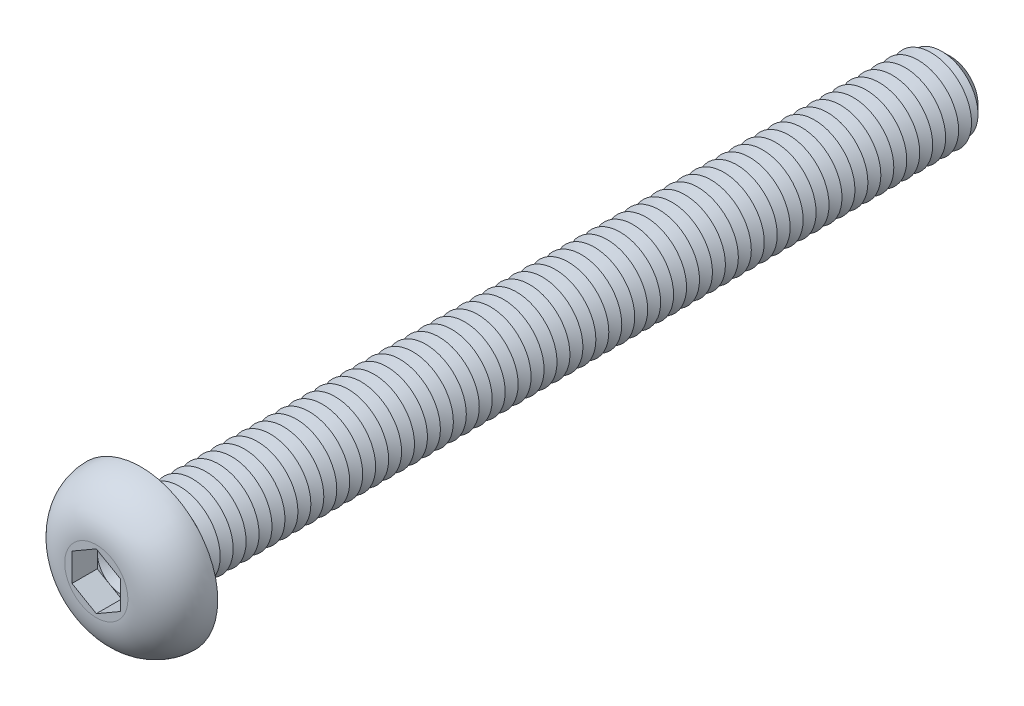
from build123d import *

# Parameters (mm, degrees)
CUT_EXTRUDE1_DEPTH  = 1.56
SKETCH4_R           = 2.5
BOSS_EXTRUDE1_DEPTH = 50
CHAMFER1_SIZE       = 0.8
LPATTERN1_COUNT     = 61
LPATTERN1_PITCH     = 0.8
FILLET2_R           = 0.4


with BuildPart() as part:
    # Sketch2 → Revolve1 (revolve)
    with BuildSketch(Plane(origin=(0, 0, 0), x_dir=(0, 0, -1), z_dir=(1, 0, 0)), mode=Mode.PRIVATE) as revolve1_sk:
        with BuildLine():
            Line((0, 0), (-2.75, 0))
            Line((-2.75, 0), (-2.75, 1.950446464))
            ThreePointArc((-2.75, 1.950446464), (-1.947498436, 3.912588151), (0, 4.75))
            Line((0, 4.75), (0, 0))
        make_face()
    revolve(revolve1_sk.sketch.rotate(Axis((0, 0, 47.934239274), (0, 0, -1)), 90), axis=Axis((0, 0, 47.934239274), (0, 0, -1)))

    # Sketch3 → Cut-Extrude1 (cut)
    with BuildSketch(Plane.XY.offset(2.75)):
        Polygon((0, 1.732050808), (-1.5, 0.866025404), (-1.5, -0.866025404), (0, -1.732050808), (1.5, -0.866025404), (1.5, 0.866025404), align=None)
    extrude(amount=-CUT_EXTRUDE1_DEPTH, mode=Mode.SUBTRACT)

    # Sketch4 → Boss-Extrude1 (add)
    with BuildSketch(Plane(origin=(0, 0, 0), x_dir=(-1, 0, 0), z_dir=(0, 0, -1))):
        with Locations(Location((0, 0, 0), (0, 0, 180))):
            Circle(SKETCH4_R)
    extrude(amount=BOSS_EXTRUDE1_DEPTH)

    # Chamfer1
    chamfer1_edges = [part.edges().sort_by_distance(p)[0] for p in [
        (-2.5, 0, -50),
    ]]
    chamfer(chamfer1_edges, length=CHAMFER1_SIZE)

    # Sketch5 → Cut-Revolve1 (revolve, cut)
    with BuildSketch(Plane(origin=(0, 0, 0), x_dir=(0, 0, -1), z_dir=(1, 0, 0)), mode=Mode.PRIVATE) as cut_revolve1_sk:
        Polygon((0.8, 2.5), (1.6, 2.5), (1.2, 1.807179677), align=None)
    cut_revolve1 = revolve(cut_revolve1_sk.sketch.rotate(Axis((0, 0, 47.934239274), (0, 0, -1)), 90), axis=Axis((0, 0, 47.934239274), (0, 0, -1)), mode=Mode.SUBTRACT)

    # LPattern1: Cut-Revolve1 ×61
    with Locations(*[(0, 0, -i * LPATTERN1_PITCH) for i in range(1, LPATTERN1_COUNT)]):
        add(cut_revolve1, mode=Mode.SUBTRACT)

    # Fillet2
    fillet2_edges = [part.edges().sort_by_distance(p)[0] for p in [
        (-2.5, 0, 0),
    ]]
    fillet(fillet2_edges, radius=FILLET2_R)

    # Cut-Extrude2 cone 1 section (on through the dimple's axis) → Cut-Extrude2 (revolve, cut)
    with BuildSketch(Plane(origin=(0, 0, 1.19), x_dir=(0, -1, 0), z_dir=(1, 0, 0))):
        Polygon((0, 0), (1.5, 0), (0, 0.866025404), align=None)
    revolve(axis=Axis((0, 0, 1.19), (0, 0, -1)), mode=Mode.SUBTRACT)


solid = part.part
